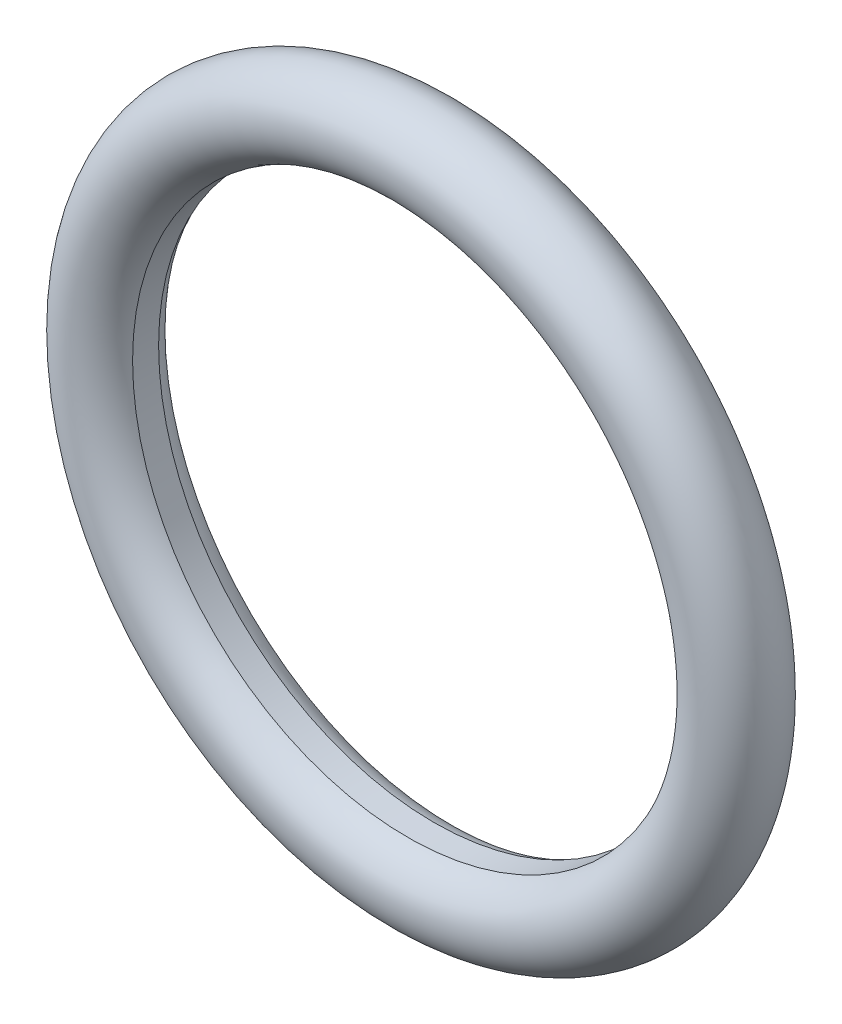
ISO-10303-21;
HEADER;
FILE_DESCRIPTION(('STEP AP214'),'2;1');
FILE_NAME('part.step','',(''),(''),'','','');
FILE_SCHEMA(('AUTOMOTIVE_DESIGN { 1 0 10303 214 1 1 1 1 }'));
ENDSEC;
DATA;
#1=APPLICATION_CONTEXT('core data for automotive mechanical design processes');
#2=APPLICATION_PROTOCOL_DEFINITION('international standard','automotive_design',2000,#1);
#3=PRODUCT_CONTEXT('',#1,'mechanical');
#4=PRODUCT('Part','Part','',(#3));
#5=PRODUCT_RELATED_PRODUCT_CATEGORY('part','',(#4));
#6=PRODUCT_DEFINITION_FORMATION('','',#4);
#7=PRODUCT_DEFINITION_CONTEXT('part definition',#1,'design');
#8=PRODUCT_DEFINITION('design','',#6,#7);
#9=PRODUCT_DEFINITION_SHAPE('','',#8);
#10=(LENGTH_UNIT() NAMED_UNIT(*) SI_UNIT(.MILLI.,.METRE.));
#11=(NAMED_UNIT(*) PLANE_ANGLE_UNIT() SI_UNIT($,.RADIAN.));
#12=(NAMED_UNIT(*) SI_UNIT($,.STERADIAN.) SOLID_ANGLE_UNIT());
#13=UNCERTAINTY_MEASURE_WITH_UNIT(LENGTH_MEASURE(1.E-05),#10,'distance_accuracy_value','');
#14=(GEOMETRIC_REPRESENTATION_CONTEXT(3) GLOBAL_UNCERTAINTY_ASSIGNED_CONTEXT((#13)) GLOBAL_UNIT_ASSIGNED_CONTEXT((#10,
#11,#12)) REPRESENTATION_CONTEXT('',''));
#15=CARTESIAN_POINT('',(0.,0.,0.));
#16=DIRECTION('',(0.,0.,1.));
#17=DIRECTION('',(1.,0.,0.));
#18=AXIS2_PLACEMENT_3D('',#15,#16,#17);
#19=CARTESIAN_POINT('',(0.,0.,0.));
#20=DIRECTION('',(0.,0.,-1.));
#21=DIRECTION('',(-0.999999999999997,0.,0.));
#22=AXIS2_PLACEMENT_3D('',#19,#20,#21);
#23=TOROIDAL_SURFACE('',#22,9.87,1.31);
#24=CARTESIAN_POINT('',(0.,0.,-0.407523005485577));
#25=DIRECTION('',(0.,0.,1.));
#26=DIRECTION('',(0.999999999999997,0.,0.));
#27=AXIS2_PLACEMENT_3D('',#24,#25,#26);
#28=CIRCLE('',#27,8.625);
#29=CARTESIAN_POINT('',(8.62499999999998,0.,-0.407523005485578));
#30=VERTEX_POINT('',#29);
#31=EDGE_CURVE('E10',#30,#30,#28,.F.);
#32=ORIENTED_EDGE('',*,*,#31,.F.);
#33=EDGE_LOOP('',(#32));
#34=FACE_BOUND('',#33,.T.);
#35=CARTESIAN_POINT('',(0.,0.,0.407523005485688));
#36=DIRECTION('',(0.,0.,-1.));
#37=DIRECTION('',(-0.999999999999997,0.,0.));
#38=AXIS2_PLACEMENT_3D('',#35,#36,#37);
#39=CIRCLE('',#38,8.625);
#40=CARTESIAN_POINT('',(-8.62499999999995,0.,0.407523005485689));
#41=VERTEX_POINT('',#40);
#42=EDGE_CURVE('E42',#41,#41,#39,.F.);
#43=ORIENTED_EDGE('',*,*,#42,.F.);
#44=EDGE_LOOP('',(#43));
#45=FACE_BOUND('',#44,.T.);
#46=ADVANCED_FACE('F36',(#34,#45),#23,.T.);
#47=CARTESIAN_POINT('',(0.,0.,-1.30999999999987));
#48=DIRECTION('',(0.,0.,1.));
#49=DIRECTION('',(0.999999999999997,0.,0.));
#50=AXIS2_PLACEMENT_3D('',#47,#48,#49);
#51=CYLINDRICAL_SURFACE('',#50,8.625);
#52=ORIENTED_EDGE('',*,*,#31,.T.);
#53=EDGE_LOOP('',(#52));
#54=FACE_BOUND('',#53,.T.);
#55=ORIENTED_EDGE('',*,*,#42,.T.);
#56=EDGE_LOOP('',(#55));
#57=FACE_BOUND('',#56,.T.);
#58=ADVANCED_FACE('F48',(#54,#57),#51,.F.);
#59=CLOSED_SHELL('',(#46,#58));
#60=MANIFOLD_SOLID_BREP('B2',#59);
#61=ADVANCED_BREP_SHAPE_REPRESENTATION('',(#18,#60),#14);
#62=SHAPE_DEFINITION_REPRESENTATION(#9,#61);
ENDSEC;
END-ISO-10303-21;
